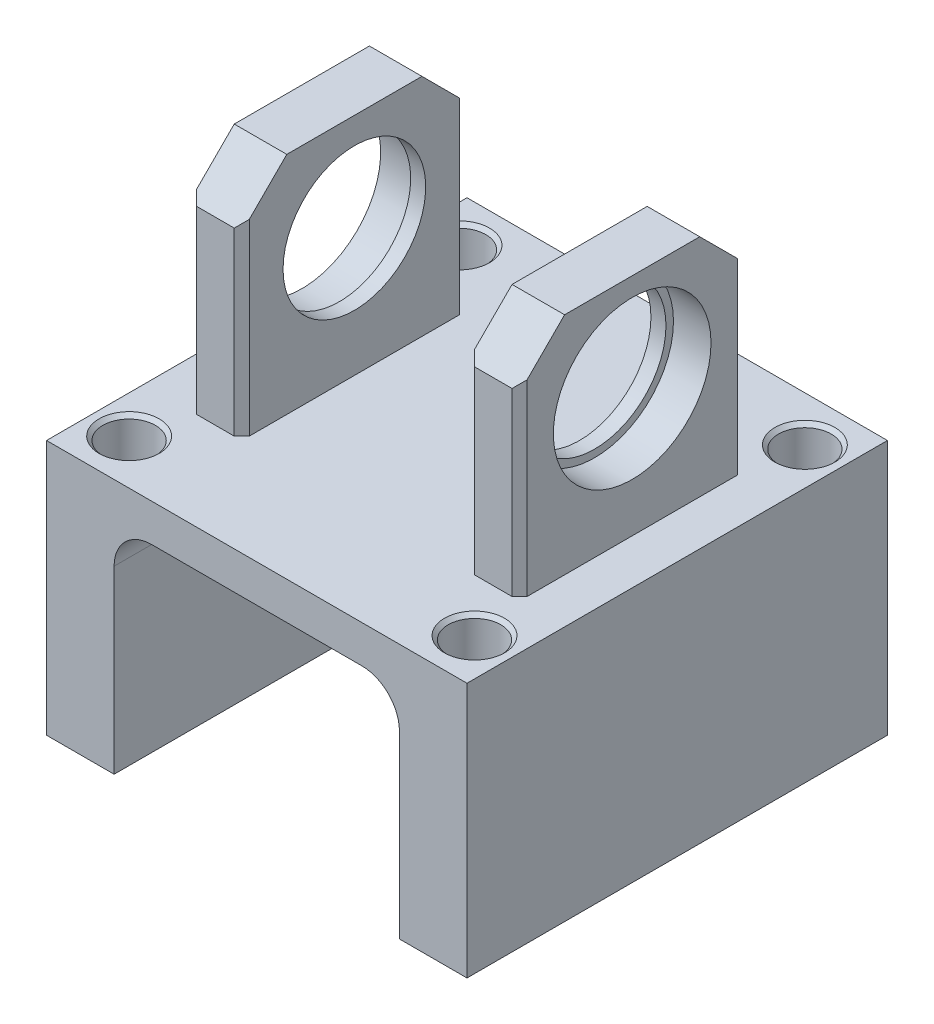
from build123d import *

# Parameters (mm, degrees)
SKETCH_1_W               = 56
SKETCH_1_H               = 56
EXTRUDE_1_DEPTH          = 34
CUT_EXTRUDE_1_DEPTH      = 53.191953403
CUT_EXTRUDE_1_DEPTH_BACK = 53.191953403
SKETCH_3_W               = 7
SKETCH_3_H               = 30
EXTRUDE_2_DEPTH          = 30
CHANFREIN1_SIZE          = 6
CHAMFER_1_SIZE           = 1
SKETCH_4_R               = 10.5
CUT_EXTRUDE_2_DEPTH      = 5
SKETCH_5_R               = 9.5
CUT_EXTRUDE_3_DEPTH      = 84.096329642
CUT_EXTRUDE_START        = -5
SKETCH_6_R               = 10.5
CUT_EXTRUDE_6_DEPTH      = 5
SKETCH_7_R               = 2.5
CUT_EXTRUDE_7_DEPTH      = 10
SKETCH_8_R               = 3.5
CUT_EXTRUDE_8_DEPTH      = 15
CHAMFER_2_SIZE           = 0.5


with BuildPart() as part:
    # Sketch 1 → Extrude 1 (new body)
    with BuildSketch(Plane(origin=(0, 0, 0), x_dir=(1, 0, 0), z_dir=(0, 1, 0))):
        Rectangle(SKETCH_1_W, SKETCH_1_H)
    extrude(amount=EXTRUDE_1_DEPTH)

    # Sketch 2 → Cut-Extrude 1 (cut, two sides: drawn at the far end of the back side and taken through both)
    with BuildSketch(Plane.XY.offset(-CUT_EXTRUDE_1_DEPTH_BACK)):
        with BuildLine():
            Line((-19, 0), (19, 0))
            Line((19, 0), (19, 24))
            ThreePointArc((19, 24), (17.535533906, 27.535533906), (14, 29))
            Line((14, 29), (-14, 29))
            ThreePointArc((-14, 29), (-17.535533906, 27.535533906), (-19, 24))
            Line((-19, 24), (-19, 0))
        make_face()
    extrude(amount=CUT_EXTRUDE_1_DEPTH + CUT_EXTRUDE_1_DEPTH_BACK, mode=Mode.SUBTRACT)

    # Sketch 3 → Extrude 2 (add)
    with BuildSketch(Plane(origin=(0, 34, 0), x_dir=(1, 0, 0), z_dir=(0, 1, 0))):
        with Locations((-18.5, 0)):
            Rectangle(SKETCH_3_W, SKETCH_3_H)
        with Locations((18.5, 0)):
            Rectangle(SKETCH_3_W, SKETCH_3_H)
    extrude(amount=EXTRUDE_2_DEPTH)

    # Chanfrein1
    chanfrein1_edges = [part.edges().sort_by_distance(p)[0] for p in [
        (-18.5, 64, 15),
        (-18.5, 64, -15),
        (18.5, 64, -15),
        (18.5, 64, 15),
    ]]
    chamfer(chanfrein1_edges, length=CHANFREIN1_SIZE)

    # Chamfer 1
    chamfer_1_edges = [part.edges().sort_by_distance(p)[0] for p in [
        (-22, 46, 15),
        (-22, 46, -15),
        (-15, 46, -15),
        (-15, 46, 15),
        (22, 46, -15),
        (22, 46, 15),
        (15, 46, 15),
        (15, 46, -15),
    ]]
    chamfer(chamfer_1_edges, length=CHAMFER_1_SIZE)

    # Sketch 4 → Cut-Extrude 2 (cut)
    with BuildSketch(Plane(origin=(22, 0, 0), x_dir=(0, 0, -1), z_dir=(1, 0, 0))):
        with Locations((0, 51)):
            Circle(SKETCH_4_R)
    extrude(amount=-CUT_EXTRUDE_2_DEPTH, mode=Mode.SUBTRACT)

    # Sketch 5 → Cut-Extrude 3 (cut, through all)
    with BuildSketch(Plane(origin=(17, 0, 0), x_dir=(0, 0, -1), z_dir=(1, 0, 0))):
        with Locations((0, 51)):
            Circle(SKETCH_5_R)
    extrude(amount=-CUT_EXTRUDE_3_DEPTH, mode=Mode.SUBTRACT)

    # Sketch 6 → Cut-Extrude 6 (cut)
    with BuildSketch(Plane.ZY.offset(22).offset(CUT_EXTRUDE_START)):
        with Locations(Location((0, 51, 0), (0, 0, 180))):
            Circle(SKETCH_6_R)
    extrude(amount=CUT_EXTRUDE_6_DEPTH, mode=Mode.SUBTRACT)

    # Sketch 7 → Cut-Extrude 7 (cut)
    with BuildSketch(Plane.XZ):
        with Locations(Location((-23, 22, 0), (0, 0, 270))):
            Circle(SKETCH_7_R)
        with Locations(Location((-23, -22, 0), (0, 0, 90))):
            Circle(SKETCH_7_R)
        with Locations(Location((23, -22, 0), (0, 0, 270))):
            Circle(SKETCH_7_R)
        with Locations(Location((23, 22, 0), (0, 0, 90))):
            Circle(SKETCH_7_R)
    extrude(amount=-CUT_EXTRUDE_7_DEPTH, mode=Mode.SUBTRACT)

    # Sketch 8 → Cut-Extrude 8 (cut)
    with BuildSketch(Plane(origin=(0, 34, 0), x_dir=(1, 0, 0), z_dir=(0, 1, 0))):
        with Locations(Location((-23, 22, 0), (0, 0, 270))):
            Circle(SKETCH_8_R)
        with Locations(Location((-23, -22, 0), (0, 0, 270))):
            Circle(SKETCH_8_R)
        with Locations(Location((23, 22, 0), (0, 0, 270))):
            Circle(SKETCH_8_R)
        with Locations(Location((23, -22, 0), (0, 0, 270))):
            Circle(SKETCH_8_R)
    extrude(amount=-CUT_EXTRUDE_8_DEPTH, mode=Mode.SUBTRACT)

    # Chamfer 2
    chamfer_2_edges = [part.edges().sort_by_distance(p)[0] for p in [
        (-23, 0, 24.5),
        (-23, 0, -24.5),
        (23, 0, -19.5),
        (23, 0, 19.5),
        (-23, 34, -25.5),
        (-23, 34, 18.5),
        (23, 34, -25.5),
        (23, 34, 18.5),
    ]]
    chamfer(chamfer_2_edges, length=CHAMFER_2_SIZE)


solid = part.part
